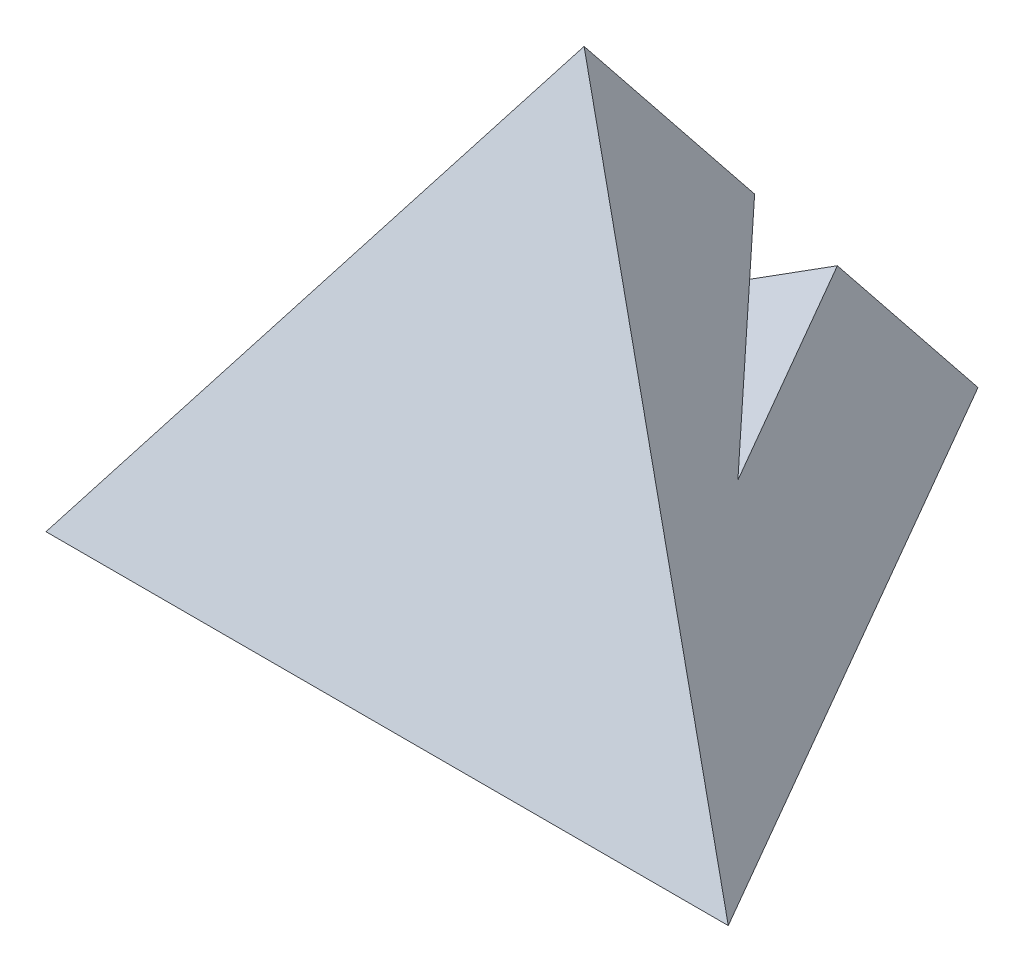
from build123d import *

# Parameters (mm, degrees)
CUT_EXTRUDE_1_DEPTH      = 2774.721867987
CUT_EXTRUDE_1_DEPTH_BACK = 2774.721867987


with BuildPart() as part:
    # Sketch 1 → Loft 1 section 0
    with BuildSketch(Plane(origin=(0, 0, 0), x_dir=(1, 0, 0), z_dir=(0, 1, 0)), mode=Mode.PRIVATE) as loft_1_s0:
        with BuildLine():
            Line((0, 1524), (-1319.822715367, -762))
            Line((-1319.822715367, -762), (1319.822715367, -762))
            Line((1319.822715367, -762), (0, 1524))
        make_face()
    loft([Vertex(0, 1905, 0), loft_1_s0.sketch])

    # Sketch 3 → Cut-Extrude 1 (cut, two sides: drawn at the far end of the back side and taken through both)
    with BuildSketch(Plane(origin=(0, 0, 0), x_dir=(0, 0, -1), z_dir=(1, 0, 0)).offset(-CUT_EXTRUDE_1_DEPTH_BACK)):
        Polygon((69.22837241, 680.128046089), (1121.029357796, 1392.748909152), (1338.77462151, 680.128046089), align=None)
    extrude(amount=CUT_EXTRUDE_1_DEPTH + CUT_EXTRUDE_1_DEPTH_BACK, mode=Mode.SUBTRACT)


solid = part.part
